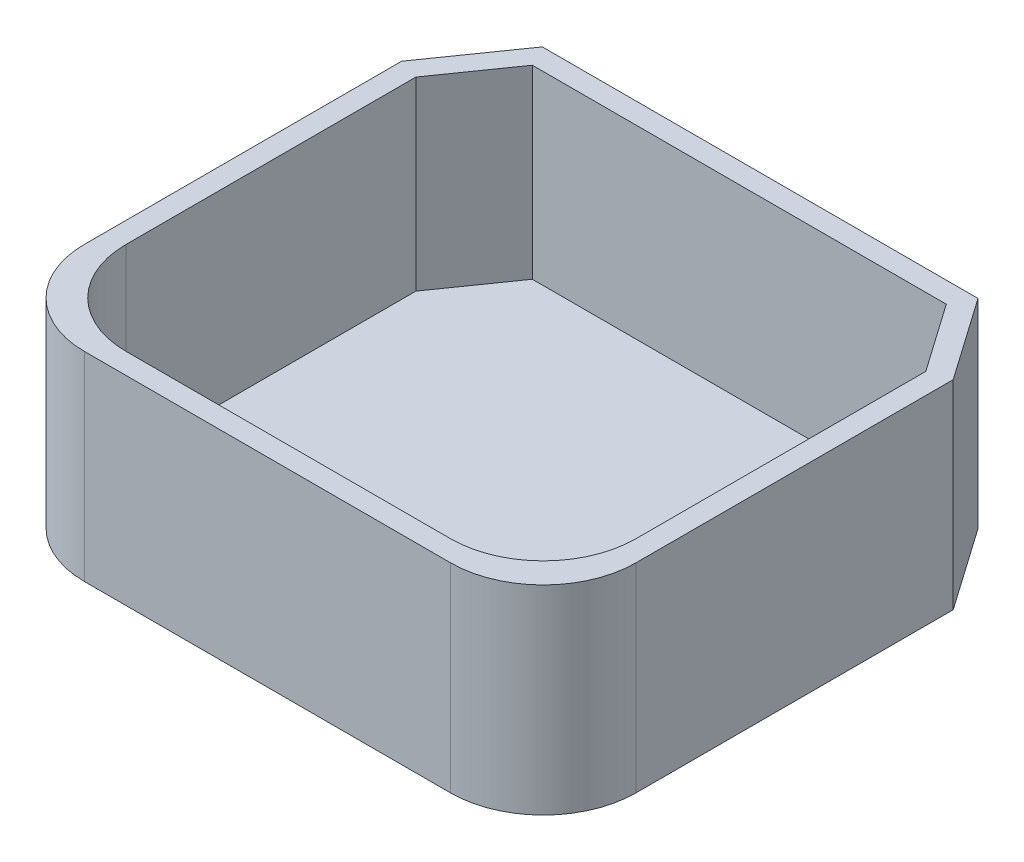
ISO-10303-21;
HEADER;
FILE_DESCRIPTION(('STEP AP214'),'2;1');
FILE_NAME('part.step','',(''),(''),'','','');
FILE_SCHEMA(('AUTOMOTIVE_DESIGN { 1 0 10303 214 1 1 1 1 }'));
ENDSEC;
DATA;
#1=APPLICATION_CONTEXT('core data for automotive mechanical design processes');
#2=APPLICATION_PROTOCOL_DEFINITION('international standard','automotive_design',2000,#1);
#3=PRODUCT_CONTEXT('',#1,'mechanical');
#4=PRODUCT('Part','Part','',(#3));
#5=PRODUCT_RELATED_PRODUCT_CATEGORY('part','',(#4));
#6=PRODUCT_DEFINITION_FORMATION('','',#4);
#7=PRODUCT_DEFINITION_CONTEXT('part definition',#1,'design');
#8=PRODUCT_DEFINITION('design','',#6,#7);
#9=PRODUCT_DEFINITION_SHAPE('','',#8);
#10=(LENGTH_UNIT() NAMED_UNIT(*) SI_UNIT(.MILLI.,.METRE.));
#11=(NAMED_UNIT(*) PLANE_ANGLE_UNIT() SI_UNIT($,.RADIAN.));
#12=(NAMED_UNIT(*) SI_UNIT($,.STERADIAN.) SOLID_ANGLE_UNIT());
#13=UNCERTAINTY_MEASURE_WITH_UNIT(LENGTH_MEASURE(1.E-05),#10,'distance_accuracy_value','');
#14=(GEOMETRIC_REPRESENTATION_CONTEXT(3) GLOBAL_UNCERTAINTY_ASSIGNED_CONTEXT((#13)) GLOBAL_UNIT_ASSIGNED_CONTEXT((#10,
#11,#12)) REPRESENTATION_CONTEXT('',''));
#15=CARTESIAN_POINT('',(0.,0.,0.));
#16=DIRECTION('',(0.,0.,1.));
#17=DIRECTION('',(1.,0.,0.));
#18=AXIS2_PLACEMENT_3D('',#15,#16,#17);
#19=CARTESIAN_POINT('',(0.,0.3,0.));
#20=DIRECTION('',(0.,1.,0.));
#21=DIRECTION('',(0.,0.,1.));
#22=AXIS2_PLACEMENT_3D('',#19,#20,#21);
#23=PLANE('',#22);
#24=CARTESIAN_POINT('',(3.5,0.3,2.865));
#25=DIRECTION('',(0.,1.,0.));
#26=DIRECTION('',(0.,0.,1.));
#27=AXIS2_PLACEMENT_3D('',#24,#25,#26);
#28=CIRCLE('',#27,2.);
#29=CARTESIAN_POINT('',(3.5,0.3,4.865));
#30=VERTEX_POINT('',#29);
#31=CARTESIAN_POINT('',(4.4,0.3,4.65105710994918));
#32=VERTEX_POINT('',#31);
#33=EDGE_CURVE('E349',#30,#32,#28,.T.);
#34=ORIENTED_EDGE('',*,*,#33,.T.);
#35=DIRECTION('',(0.,0.,1.));
#36=VECTOR('',#35,1.);
#37=CARTESIAN_POINT('',(4.4,0.3,3.265));
#38=LINE('',#37,#36);
#39=CARTESIAN_POINT('',(4.4,0.3,3.265));
#40=VERTEX_POINT('',#39);
#41=EDGE_CURVE('E221',#40,#32,#38,.T.);
#42=ORIENTED_EDGE('',*,*,#41,.F.);
#43=DIRECTION('',(-1.,0.,0.));
#44=VECTOR('',#43,1.);
#45=CARTESIAN_POINT('',(4.7,0.3,3.265));
#46=LINE('',#45,#44);
#47=CARTESIAN_POINT('',(4.7,0.3,3.265));
#48=VERTEX_POINT('',#47);
#49=EDGE_CURVE('E224',#48,#40,#46,.T.);
#50=ORIENTED_EDGE('',*,*,#49,.F.);
#51=DIRECTION('',(0.,0.,-1.));
#52=VECTOR('',#51,1.);
#53=CARTESIAN_POINT('',(4.7,0.3,4.865));
#54=LINE('',#53,#52);
#55=CARTESIAN_POINT('',(4.7,0.3,4.465));
#56=VERTEX_POINT('',#55);
#57=EDGE_CURVE('E209',#56,#48,#54,.T.);
#58=ORIENTED_EDGE('',*,*,#57,.F.);
#59=CARTESIAN_POINT('',(5.5,0.3,2.865));
#60=VERTEX_POINT('',#59);
#61=EDGE_CURVE('E348',#56,#60,#28,.T.);
#62=ORIENTED_EDGE('',*,*,#61,.T.);
#63=DIRECTION('',(0.,0.,-1.));
#64=VECTOR('',#63,1.);
#65=CARTESIAN_POINT('',(5.5,0.3,4.865));
#66=LINE('',#65,#64);
#67=CARTESIAN_POINT('',(5.5,0.3,-3.38793053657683));
#68=VERTEX_POINT('',#67);
#69=EDGE_CURVE('E268',#60,#68,#66,.T.);
#70=ORIENTED_EDGE('',*,*,#69,.T.);
#71=DIRECTION('',(-0.57357643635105,0.,-0.819152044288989));
#72=VECTOR('',#71,1.);
#73=CARTESIAN_POINT('',(5.5,0.3,-3.38793053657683));
#74=LINE('',#73,#72);
#75=CARTESIAN_POINT('',(4.46574482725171,0.3,-4.865));
#76=VERTEX_POINT('',#75);
#77=EDGE_CURVE('E246',#68,#76,#74,.T.);
#78=ORIENTED_EDGE('',*,*,#77,.T.);
#79=DIRECTION('',(-1.,0.,0.));
#80=VECTOR('',#79,1.);
#81=CARTESIAN_POINT('',(4.46574482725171,0.3,-4.865));
#82=LINE('',#81,#80);
#83=CARTESIAN_POINT('',(-4.46574482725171,0.3,-4.865));
#84=VERTEX_POINT('',#83);
#85=EDGE_CURVE('E242',#76,#84,#82,.T.);
#86=ORIENTED_EDGE('',*,*,#85,.T.);
#87=DIRECTION('',(-0.573576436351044,0.,0.819152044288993));
#88=VECTOR('',#87,1.);
#89=CARTESIAN_POINT('',(-4.46574482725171,0.3,-4.865));
#90=LINE('',#89,#88);
#91=CARTESIAN_POINT('',(-5.5,0.3,-3.3879305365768));
#92=VERTEX_POINT('',#91);
#93=EDGE_CURVE('E260',#84,#92,#90,.T.);
#94=ORIENTED_EDGE('',*,*,#93,.T.);
#95=DIRECTION('',(0.,0.,1.));
#96=VECTOR('',#95,1.);
#97=CARTESIAN_POINT('',(-5.5,0.3,-3.3879305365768));
#98=LINE('',#97,#96);
#99=CARTESIAN_POINT('',(-5.5,0.3,2.865));
#100=VERTEX_POINT('',#99);
#101=EDGE_CURVE('E262',#92,#100,#98,.T.);
#102=ORIENTED_EDGE('',*,*,#101,.T.);
#103=CARTESIAN_POINT('',(-3.5,0.3,2.865));
#104=DIRECTION('',(0.,1.,0.));
#105=DIRECTION('',(0.,0.,1.));
#106=AXIS2_PLACEMENT_3D('',#103,#104,#105);
#107=CIRCLE('',#106,2.);
#108=CARTESIAN_POINT('',(-4.7,0.3,4.465));
#109=VERTEX_POINT('',#108);
#110=EDGE_CURVE('E345',#100,#109,#107,.T.);
#111=ORIENTED_EDGE('',*,*,#110,.T.);
#112=DIRECTION('',(0.,0.,1.));
#113=VECTOR('',#112,1.);
#114=CARTESIAN_POINT('',(-4.7,0.3,3.265));
#115=LINE('',#114,#113);
#116=CARTESIAN_POINT('',(-4.7,0.3,3.265));
#117=VERTEX_POINT('',#116);
#118=EDGE_CURVE('E212',#117,#109,#115,.T.);
#119=ORIENTED_EDGE('',*,*,#118,.F.);
#120=DIRECTION('',(-1.,0.,0.));
#121=VECTOR('',#120,1.);
#122=CARTESIAN_POINT('',(-4.4,0.3,3.265));
#123=LINE('',#122,#121);
#124=CARTESIAN_POINT('',(-4.4,0.3,3.265));
#125=VERTEX_POINT('',#124);
#126=EDGE_CURVE('E228',#125,#117,#123,.T.);
#127=ORIENTED_EDGE('',*,*,#126,.F.);
#128=DIRECTION('',(0.,0.,-1.));
#129=VECTOR('',#128,1.);
#130=CARTESIAN_POINT('',(-4.4,0.3,4.865));
#131=LINE('',#130,#129);
#132=CARTESIAN_POINT('',(-4.4,0.3,4.65105710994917));
#133=VERTEX_POINT('',#132);
#134=EDGE_CURVE('E234',#133,#125,#131,.T.);
#135=ORIENTED_EDGE('',*,*,#134,.F.);
#136=CARTESIAN_POINT('',(-3.5,0.3,4.865));
#137=VERTEX_POINT('',#136);
#138=EDGE_CURVE('E344',#133,#137,#107,.T.);
#139=ORIENTED_EDGE('',*,*,#138,.T.);
#140=DIRECTION('',(1.,0.,0.));
#141=VECTOR('',#140,1.);
#142=CARTESIAN_POINT('',(-5.5,0.3,4.865));
#143=LINE('',#142,#141);
#144=EDGE_CURVE('E265',#137,#30,#143,.T.);
#145=ORIENTED_EDGE('',*,*,#144,.T.);
#146=EDGE_LOOP('',(#34,#42,#50,#58,#62,#70,#78,#86,#94,#102,#111,#119,#127,#135,#139,#145));
#147=FACE_BOUND('',#146,.T.);
#148=ADVANCED_FACE('F36',(#147),#23,.T.);
#149=CARTESIAN_POINT('',(3.5,4.3,2.865));
#150=DIRECTION('',(0.,1.,0.));
#151=DIRECTION('',(0.,0.,1.));
#152=AXIS2_PLACEMENT_3D('',#149,#150,#151);
#153=CYLINDRICAL_SURFACE('',#152,2.);
#154=DIRECTION('',(0.,1.,0.));
#155=VECTOR('',#154,1.);
#156=CARTESIAN_POINT('',(4.4,4.3,4.65105710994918));
#157=LINE('',#156,#155);
#158=CARTESIAN_POINT('',(4.4,2.3,4.65105710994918));
#159=VERTEX_POINT('',#158);
#160=EDGE_CURVE('E11',#32,#159,#157,.T.);
#161=ORIENTED_EDGE('',*,*,#160,.F.);
#162=ORIENTED_EDGE('',*,*,#33,.F.);
#163=DIRECTION('',(0.,-1.,0.));
#164=VECTOR('',#163,1.);
#165=CARTESIAN_POINT('',(3.5,0.3,4.865));
#166=LINE('',#165,#164);
#167=CARTESIAN_POINT('',(3.5,4.3,4.865));
#168=VERTEX_POINT('',#167);
#169=EDGE_CURVE('E341',#168,#30,#166,.T.);
#170=ORIENTED_EDGE('',*,*,#169,.F.);
#171=CARTESIAN_POINT('',(3.5,4.3,2.865));
#172=DIRECTION('',(0.,1.,0.));
#173=DIRECTION('',(0.,0.,1.));
#174=AXIS2_PLACEMENT_3D('',#171,#172,#173);
#175=CIRCLE('',#174,2.);
#176=CARTESIAN_POINT('',(5.5,4.3,2.865));
#177=VERTEX_POINT('',#176);
#178=EDGE_CURVE('E357',#177,#168,#175,.F.);
#179=ORIENTED_EDGE('',*,*,#178,.F.);
#180=DIRECTION('',(0.,-1.,0.));
#181=VECTOR('',#180,1.);
#182=CARTESIAN_POINT('',(5.5,4.3,2.865));
#183=LINE('',#182,#181);
#184=EDGE_CURVE('E352',#60,#177,#183,.F.);
#185=ORIENTED_EDGE('',*,*,#184,.F.);
#186=ORIENTED_EDGE('',*,*,#61,.F.);
#187=DIRECTION('',(0.,1.,0.));
#188=VECTOR('',#187,1.);
#189=CARTESIAN_POINT('',(4.7,4.3,4.465));
#190=LINE('',#189,#188);
#191=CARTESIAN_POINT('',(4.7,2.3,4.465));
#192=VERTEX_POINT('',#191);
#193=EDGE_CURVE('E44',#192,#56,#190,.F.);
#194=ORIENTED_EDGE('',*,*,#193,.F.);
#195=CARTESIAN_POINT('',(3.5,2.3,2.865));
#196=DIRECTION('',(0.,1.,0.));
#197=DIRECTION('',(0.,0.,1.));
#198=AXIS2_PLACEMENT_3D('',#195,#196,#197);
#199=CIRCLE('',#198,2.);
#200=EDGE_CURVE('E201',#192,#159,#199,.F.);
#201=ORIENTED_EDGE('',*,*,#200,.T.);
#202=EDGE_LOOP('',(#161,#162,#170,#179,#185,#186,#194,#201));
#203=FACE_BOUND('',#202,.T.);
#204=ADVANCED_FACE('F379',(#203),#153,.F.);
#205=CARTESIAN_POINT('',(-3.5,4.3,2.865));
#206=DIRECTION('',(0.,1.,0.));
#207=DIRECTION('',(0.,0.,1.));
#208=AXIS2_PLACEMENT_3D('',#205,#206,#207);
#209=CYLINDRICAL_SURFACE('',#208,2.);
#210=DIRECTION('',(0.,1.,0.));
#211=VECTOR('',#210,1.);
#212=CARTESIAN_POINT('',(-4.7,4.3,4.465));
#213=LINE('',#212,#211);
#214=CARTESIAN_POINT('',(-4.7,2.3,4.465));
#215=VERTEX_POINT('',#214);
#216=EDGE_CURVE('E370',#109,#215,#213,.T.);
#217=ORIENTED_EDGE('',*,*,#216,.F.);
#218=ORIENTED_EDGE('',*,*,#110,.F.);
#219=DIRECTION('',(0.,-1.,0.));
#220=VECTOR('',#219,1.);
#221=CARTESIAN_POINT('',(-5.5,0.3,2.865));
#222=LINE('',#221,#220);
#223=CARTESIAN_POINT('',(-5.5,4.3,2.865));
#224=VERTEX_POINT('',#223);
#225=EDGE_CURVE('E354',#224,#100,#222,.T.);
#226=ORIENTED_EDGE('',*,*,#225,.F.);
#227=CARTESIAN_POINT('',(-3.5,4.3,2.865));
#228=DIRECTION('',(0.,1.,0.));
#229=DIRECTION('',(0.,0.,1.));
#230=AXIS2_PLACEMENT_3D('',#227,#228,#229);
#231=CIRCLE('',#230,2.);
#232=CARTESIAN_POINT('',(-3.5,4.3,4.865));
#233=VERTEX_POINT('',#232);
#234=EDGE_CURVE('E359',#233,#224,#231,.F.);
#235=ORIENTED_EDGE('',*,*,#234,.F.);
#236=DIRECTION('',(0.,-1.,0.));
#237=VECTOR('',#236,1.);
#238=CARTESIAN_POINT('',(-3.5,4.3,4.865));
#239=LINE('',#238,#237);
#240=EDGE_CURVE('E339',#137,#233,#239,.F.);
#241=ORIENTED_EDGE('',*,*,#240,.F.);
#242=ORIENTED_EDGE('',*,*,#138,.F.);
#243=DIRECTION('',(0.,1.,0.));
#244=VECTOR('',#243,1.);
#245=CARTESIAN_POINT('',(-4.4,4.3,4.65105710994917));
#246=LINE('',#245,#244);
#247=CARTESIAN_POINT('',(-4.4,2.3,4.65105710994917));
#248=VERTEX_POINT('',#247);
#249=EDGE_CURVE('E368',#248,#133,#246,.F.);
#250=ORIENTED_EDGE('',*,*,#249,.F.);
#251=CARTESIAN_POINT('',(-3.5,2.3,2.865));
#252=DIRECTION('',(0.,1.,0.));
#253=DIRECTION('',(0.,0.,1.));
#254=AXIS2_PLACEMENT_3D('',#251,#252,#253);
#255=CIRCLE('',#254,2.);
#256=EDGE_CURVE('E365',#248,#215,#255,.F.);
#257=ORIENTED_EDGE('',*,*,#256,.T.);
#258=EDGE_LOOP('',(#217,#218,#226,#235,#241,#242,#250,#257));
#259=FACE_BOUND('',#258,.T.);
#260=ADVANCED_FACE('F38',(#259),#209,.F.);
#261=CARTESIAN_POINT('',(-5.95,0.3,-3.52981499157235));
#262=DIRECTION('',(1.,0.,0.));
#263=DIRECTION('',(0.,0.,-1.));
#264=AXIS2_PLACEMENT_3D('',#261,#262,#263);
#265=PLANE('',#264);
#266=DIRECTION('',(0.,0.,1.));
#267=VECTOR('',#266,1.);
#268=CARTESIAN_POINT('',(-5.95,0.,-3.52981499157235));
#269=LINE('',#268,#267);
#270=CARTESIAN_POINT('',(-5.95,0.,-3.52981499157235));
#271=VERTEX_POINT('',#270);
#272=CARTESIAN_POINT('',(-5.95,0.,3.315));
#273=VERTEX_POINT('',#272);
#274=EDGE_CURVE('E299',#271,#273,#269,.T.);
#275=ORIENTED_EDGE('',*,*,#274,.T.);
#276=DIRECTION('',(0.,-1.,0.));
#277=VECTOR('',#276,1.);
#278=CARTESIAN_POINT('',(-5.95,0.3,3.315));
#279=LINE('',#278,#277);
#280=CARTESIAN_POINT('',(-5.95,4.3,3.315));
#281=VERTEX_POINT('',#280);
#282=EDGE_CURVE('E334',#273,#281,#279,.F.);
#283=ORIENTED_EDGE('',*,*,#282,.T.);
#284=DIRECTION('',(0.,0.,1.));
#285=VECTOR('',#284,1.);
#286=CARTESIAN_POINT('',(-5.95,4.3,-3.52981499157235));
#287=LINE('',#286,#285);
#288=CARTESIAN_POINT('',(-5.95,4.3,-3.52981499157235));
#289=VERTEX_POINT('',#288);
#290=EDGE_CURVE('E288',#289,#281,#287,.T.);
#291=ORIENTED_EDGE('',*,*,#290,.F.);
#292=DIRECTION('',(0.,-1.,0.));
#293=VECTOR('',#292,1.);
#294=CARTESIAN_POINT('',(-5.95,0.3,-3.52981499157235));
#295=LINE('',#294,#293);
#296=EDGE_CURVE('E313',#289,#271,#295,.T.);
#297=ORIENTED_EDGE('',*,*,#296,.T.);
#298=EDGE_LOOP('',(#275,#283,#291,#297));
#299=FACE_BOUND('',#298,.T.);
#300=ADVANCED_FACE('F472',(#299),#265,.F.);
#301=CARTESIAN_POINT('',(-5.95,0.3,5.315));
#302=DIRECTION('',(0.,0.,-1.));
#303=DIRECTION('',(-1.,0.,0.));
#304=AXIS2_PLACEMENT_3D('',#301,#302,#303);
#305=PLANE('',#304);
#306=DIRECTION('',(1.,0.,0.));
#307=VECTOR('',#306,1.);
#308=CARTESIAN_POINT('',(-5.95,4.3,5.315));
#309=LINE('',#308,#307);
#310=CARTESIAN_POINT('',(-3.95,4.3,5.315));
#311=VERTEX_POINT('',#310);
#312=CARTESIAN_POINT('',(3.95,4.3,5.315));
#313=VERTEX_POINT('',#312);
#314=EDGE_CURVE('E291',#311,#313,#309,.T.);
#315=ORIENTED_EDGE('',*,*,#314,.F.);
#316=DIRECTION('',(0.,-1.,0.));
#317=VECTOR('',#316,1.);
#318=CARTESIAN_POINT('',(-3.95,0.3,5.315));
#319=LINE('',#318,#317);
#320=CARTESIAN_POINT('',(-3.95,0.,5.315));
#321=VERTEX_POINT('',#320);
#322=EDGE_CURVE('E327',#311,#321,#319,.T.);
#323=ORIENTED_EDGE('',*,*,#322,.T.);
#324=DIRECTION('',(1.,0.,0.));
#325=VECTOR('',#324,1.);
#326=CARTESIAN_POINT('',(-5.95,0.,5.315));
#327=LINE('',#326,#325);
#328=CARTESIAN_POINT('',(3.95,0.,5.315));
#329=VERTEX_POINT('',#328);
#330=EDGE_CURVE('E302',#321,#329,#327,.T.);
#331=ORIENTED_EDGE('',*,*,#330,.T.);
#332=DIRECTION('',(0.,-1.,0.));
#333=VECTOR('',#332,1.);
#334=CARTESIAN_POINT('',(3.95,0.3,5.315));
#335=LINE('',#334,#333);
#336=EDGE_CURVE('E325',#329,#313,#335,.F.);
#337=ORIENTED_EDGE('',*,*,#336,.T.);
#338=EDGE_LOOP('',(#315,#323,#331,#337));
#339=FACE_BOUND('',#338,.T.);
#340=ADVANCED_FACE('F468',(#339),#305,.F.);
#341=CARTESIAN_POINT('',(5.95,0.3,-3.52981499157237));
#342=DIRECTION('',(-1.,0.,0.));
#343=DIRECTION('',(0.,0.,1.));
#344=AXIS2_PLACEMENT_3D('',#341,#342,#343);
#345=PLANE('',#344);
#346=DIRECTION('',(0.,0.,-1.));
#347=VECTOR('',#346,1.);
#348=CARTESIAN_POINT('',(5.95,4.3,5.315));
#349=LINE('',#348,#347);
#350=CARTESIAN_POINT('',(5.95,4.3,3.315));
#351=VERTEX_POINT('',#350);
#352=CARTESIAN_POINT('',(5.95,4.3,-3.52981499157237));
#353=VERTEX_POINT('',#352);
#354=EDGE_CURVE('E294',#351,#353,#349,.T.);
#355=ORIENTED_EDGE('',*,*,#354,.F.);
#356=DIRECTION('',(0.,-1.,0.));
#357=VECTOR('',#356,1.);
#358=CARTESIAN_POINT('',(5.95,0.3,3.315));
#359=LINE('',#358,#357);
#360=CARTESIAN_POINT('',(5.95,0.,3.315));
#361=VERTEX_POINT('',#360);
#362=EDGE_CURVE('E336',#351,#361,#359,.T.);
#363=ORIENTED_EDGE('',*,*,#362,.T.);
#364=DIRECTION('',(0.,0.,-1.));
#365=VECTOR('',#364,1.);
#366=CARTESIAN_POINT('',(5.95,0.,-3.52981499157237));
#367=LINE('',#366,#365);
#368=CARTESIAN_POINT('',(5.95,0.,-3.52981499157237));
#369=VERTEX_POINT('',#368);
#370=EDGE_CURVE('E305',#361,#369,#367,.T.);
#371=ORIENTED_EDGE('',*,*,#370,.T.);
#372=DIRECTION('',(0.,-1.,0.));
#373=VECTOR('',#372,1.);
#374=CARTESIAN_POINT('',(5.95,0.3,-3.52981499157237));
#375=LINE('',#374,#373);
#376=EDGE_CURVE('E322',#353,#369,#375,.T.);
#377=ORIENTED_EDGE('',*,*,#376,.F.);
#378=EDGE_LOOP('',(#355,#363,#371,#377));
#379=FACE_BOUND('',#378,.T.);
#380=ADVANCED_FACE('F464',(#379),#345,.F.);
#381=CARTESIAN_POINT('',(4.7,0.3,-5.315));
#382=DIRECTION('',(-0.819152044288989,0.,0.57357643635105));
#383=DIRECTION('',(0.57357643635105,0.,0.819152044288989));
#384=AXIS2_PLACEMENT_3D('',#381,#382,#383);
#385=PLANE('',#384);
#386=DIRECTION('',(-0.57357643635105,0.,-0.819152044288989));
#387=VECTOR('',#386,1.);
#388=CARTESIAN_POINT('',(4.7,0.,-5.315));
#389=LINE('',#388,#387);
#390=CARTESIAN_POINT('',(4.7,0.,-5.315));
#391=VERTEX_POINT('',#390);
#392=EDGE_CURVE('E307',#369,#391,#389,.T.);
#393=ORIENTED_EDGE('',*,*,#392,.T.);
#394=DIRECTION('',(0.,-1.,0.));
#395=VECTOR('',#394,1.);
#396=CARTESIAN_POINT('',(4.7,0.3,-5.315));
#397=LINE('',#396,#395);
#398=CARTESIAN_POINT('',(4.7,4.3,-5.315));
#399=VERTEX_POINT('',#398);
#400=EDGE_CURVE('E319',#399,#391,#397,.T.);
#401=ORIENTED_EDGE('',*,*,#400,.F.);
#402=DIRECTION('',(-0.57357643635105,0.,-0.819152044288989));
#403=VECTOR('',#402,1.);
#404=CARTESIAN_POINT('',(5.95,4.3,-3.52981499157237));
#405=LINE('',#404,#403);
#406=EDGE_CURVE('E296',#353,#399,#405,.T.);
#407=ORIENTED_EDGE('',*,*,#406,.F.);
#408=ORIENTED_EDGE('',*,*,#376,.T.);
#409=EDGE_LOOP('',(#393,#401,#407,#408));
#410=FACE_BOUND('',#409,.T.);
#411=ADVANCED_FACE('F460',(#410),#385,.F.);
#412=CARTESIAN_POINT('',(4.7,0.3,-5.315));
#413=DIRECTION('',(0.,0.,1.));
#414=DIRECTION('',(1.,0.,0.));
#415=AXIS2_PLACEMENT_3D('',#412,#413,#414);
#416=PLANE('',#415);
#417=DIRECTION('',(-1.,0.,0.));
#418=VECTOR('',#417,1.);
#419=CARTESIAN_POINT('',(4.7,0.,-5.315));
#420=LINE('',#419,#418);
#421=CARTESIAN_POINT('',(-4.7,0.,-5.315));
#422=VERTEX_POINT('',#421);
#423=EDGE_CURVE('E309',#391,#422,#420,.T.);
#424=ORIENTED_EDGE('',*,*,#423,.T.);
#425=DIRECTION('',(0.,-1.,0.));
#426=VECTOR('',#425,1.);
#427=CARTESIAN_POINT('',(-4.7,0.3,-5.315));
#428=LINE('',#427,#426);
#429=CARTESIAN_POINT('',(-4.7,4.3,-5.315));
#430=VERTEX_POINT('',#429);
#431=EDGE_CURVE('E316',#430,#422,#428,.T.);
#432=ORIENTED_EDGE('',*,*,#431,.F.);
#433=DIRECTION('',(-1.,0.,0.));
#434=VECTOR('',#433,1.);
#435=CARTESIAN_POINT('',(4.7,4.3,-5.315));
#436=LINE('',#435,#434);
#437=EDGE_CURVE('E282',#399,#430,#436,.T.);
#438=ORIENTED_EDGE('',*,*,#437,.F.);
#439=ORIENTED_EDGE('',*,*,#400,.T.);
#440=EDGE_LOOP('',(#424,#432,#438,#439));
#441=FACE_BOUND('',#440,.T.);
#442=ADVANCED_FACE('F456',(#441),#416,.F.);
#443=CARTESIAN_POINT('',(-4.7,0.3,-5.315));
#444=DIRECTION('',(0.819152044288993,0.,0.573576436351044));
#445=DIRECTION('',(0.573576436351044,0.,-0.819152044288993));
#446=AXIS2_PLACEMENT_3D('',#443,#444,#445);
#447=PLANE('',#446);
#448=DIRECTION('',(-0.573576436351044,0.,0.819152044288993));
#449=VECTOR('',#448,1.);
#450=CARTESIAN_POINT('',(-4.7,0.,-5.315));
#451=LINE('',#450,#449);
#452=EDGE_CURVE('E311',#422,#271,#451,.T.);
#453=ORIENTED_EDGE('',*,*,#452,.T.);
#454=ORIENTED_EDGE('',*,*,#296,.F.);
#455=DIRECTION('',(-0.573576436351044,0.,0.819152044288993));
#456=VECTOR('',#455,1.);
#457=CARTESIAN_POINT('',(-4.7,4.3,-5.315));
#458=LINE('',#457,#456);
#459=EDGE_CURVE('E285',#430,#289,#458,.T.);
#460=ORIENTED_EDGE('',*,*,#459,.F.);
#461=ORIENTED_EDGE('',*,*,#431,.T.);
#462=EDGE_LOOP('',(#453,#454,#460,#461));
#463=FACE_BOUND('',#462,.T.);
#464=ADVANCED_FACE('F452',(#463),#447,.F.);
#465=CARTESIAN_POINT('',(0.,0.,0.));
#466=DIRECTION('',(0.,1.,0.));
#467=DIRECTION('',(0.,0.,1.));
#468=AXIS2_PLACEMENT_3D('',#465,#466,#467);
#469=PLANE('',#468);
#470=ORIENTED_EDGE('',*,*,#330,.F.);
#471=CARTESIAN_POINT('',(-3.95,0.,3.315));
#472=DIRECTION('',(0.,1.,0.));
#473=DIRECTION('',(0.,0.,1.));
#474=AXIS2_PLACEMENT_3D('',#471,#472,#473);
#475=CIRCLE('',#474,2.);
#476=EDGE_CURVE('E332',#321,#273,#475,.F.);
#477=ORIENTED_EDGE('',*,*,#476,.T.);
#478=ORIENTED_EDGE('',*,*,#274,.F.);
#479=ORIENTED_EDGE('',*,*,#452,.F.);
#480=ORIENTED_EDGE('',*,*,#423,.F.);
#481=ORIENTED_EDGE('',*,*,#392,.F.);
#482=ORIENTED_EDGE('',*,*,#370,.F.);
#483=CARTESIAN_POINT('',(3.95,0.,3.315));
#484=DIRECTION('',(0.,1.,0.));
#485=DIRECTION('',(0.,0.,1.));
#486=AXIS2_PLACEMENT_3D('',#483,#484,#485);
#487=CIRCLE('',#486,2.);
#488=EDGE_CURVE('E330',#361,#329,#487,.F.);
#489=ORIENTED_EDGE('',*,*,#488,.T.);
#490=EDGE_LOOP('',(#470,#477,#478,#479,#480,#481,#482,#489));
#491=FACE_BOUND('',#490,.T.);
#492=ADVANCED_FACE('F449',(#491),#469,.F.);
#493=CARTESIAN_POINT('',(0.,4.3,0.));
#494=DIRECTION('',(0.,1.,0.));
#495=DIRECTION('',(0.,0.,1.));
#496=AXIS2_PLACEMENT_3D('',#493,#494,#495);
#497=PLANE('',#496);
#498=ORIENTED_EDGE('',*,*,#290,.T.);
#499=CARTESIAN_POINT('',(-3.95,4.3,3.315));
#500=DIRECTION('',(0.,1.,0.));
#501=DIRECTION('',(0.,0.,1.));
#502=AXIS2_PLACEMENT_3D('',#499,#500,#501);
#503=CIRCLE('',#502,2.);
#504=EDGE_CURVE('E363',#281,#311,#503,.T.);
#505=ORIENTED_EDGE('',*,*,#504,.T.);
#506=ORIENTED_EDGE('',*,*,#314,.T.);
#507=CARTESIAN_POINT('',(3.95,4.3,3.315));
#508=DIRECTION('',(0.,1.,0.));
#509=DIRECTION('',(0.,0.,1.));
#510=AXIS2_PLACEMENT_3D('',#507,#508,#509);
#511=CIRCLE('',#510,2.);
#512=EDGE_CURVE('E361',#313,#351,#511,.T.);
#513=ORIENTED_EDGE('',*,*,#512,.T.);
#514=ORIENTED_EDGE('',*,*,#354,.T.);
#515=ORIENTED_EDGE('',*,*,#406,.T.);
#516=ORIENTED_EDGE('',*,*,#437,.T.);
#517=ORIENTED_EDGE('',*,*,#459,.T.);
#518=EDGE_LOOP('',(#498,#505,#506,#513,#514,#515,#516,#517));
#519=FACE_BOUND('',#518,.T.);
#520=DIRECTION('',(-0.573576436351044,0.,0.819152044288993));
#521=VECTOR('',#520,1.);
#522=CARTESIAN_POINT('',(-4.46574482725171,4.3,-4.865));
#523=LINE('',#522,#521);
#524=CARTESIAN_POINT('',(-4.46574482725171,4.3,-4.865));
#525=VERTEX_POINT('',#524);
#526=CARTESIAN_POINT('',(-5.5,4.3,-3.3879305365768));
#527=VERTEX_POINT('',#526);
#528=EDGE_CURVE('E245',#525,#527,#523,.T.);
#529=ORIENTED_EDGE('',*,*,#528,.F.);
#530=DIRECTION('',(-1.,0.,0.));
#531=VECTOR('',#530,1.);
#532=CARTESIAN_POINT('',(4.46574482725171,4.3,-4.865));
#533=LINE('',#532,#531);
#534=CARTESIAN_POINT('',(4.46574482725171,4.3,-4.865));
#535=VERTEX_POINT('',#534);
#536=EDGE_CURVE('E243',#535,#525,#533,.T.);
#537=ORIENTED_EDGE('',*,*,#536,.F.);
#538=DIRECTION('',(-0.57357643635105,0.,-0.819152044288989));
#539=VECTOR('',#538,1.);
#540=CARTESIAN_POINT('',(5.5,4.3,-3.38793053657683));
#541=LINE('',#540,#539);
#542=CARTESIAN_POINT('',(5.5,4.3,-3.38793053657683));
#543=VERTEX_POINT('',#542);
#544=EDGE_CURVE('E256',#543,#535,#541,.T.);
#545=ORIENTED_EDGE('',*,*,#544,.F.);
#546=DIRECTION('',(0.,0.,-1.));
#547=VECTOR('',#546,1.);
#548=CARTESIAN_POINT('',(5.5,4.3,4.865));
#549=LINE('',#548,#547);
#550=EDGE_CURVE('E254',#177,#543,#549,.T.);
#551=ORIENTED_EDGE('',*,*,#550,.F.);
#552=ORIENTED_EDGE('',*,*,#178,.T.);
#553=DIRECTION('',(1.,0.,0.));
#554=VECTOR('',#553,1.);
#555=CARTESIAN_POINT('',(-5.5,4.3,4.865));
#556=LINE('',#555,#554);
#557=EDGE_CURVE('E251',#233,#168,#556,.T.);
#558=ORIENTED_EDGE('',*,*,#557,.F.);
#559=ORIENTED_EDGE('',*,*,#234,.T.);
#560=DIRECTION('',(0.,0.,1.));
#561=VECTOR('',#560,1.);
#562=CARTESIAN_POINT('',(-5.5,4.3,-3.3879305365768));
#563=LINE('',#562,#561);
#564=EDGE_CURVE('E248',#527,#224,#563,.T.);
#565=ORIENTED_EDGE('',*,*,#564,.F.);
#566=EDGE_LOOP('',(#529,#537,#545,#551,#552,#558,#559,#565));
#567=FACE_BOUND('',#566,.T.);
#568=ADVANCED_FACE('F389',(#519,#567),#497,.T.);
#569=CARTESIAN_POINT('',(4.46574482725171,4.3,-4.865));
#570=DIRECTION('',(0.,0.,1.));
#571=DIRECTION('',(1.,0.,0.));
#572=AXIS2_PLACEMENT_3D('',#569,#570,#571);
#573=PLANE('',#572);
#574=ORIENTED_EDGE('',*,*,#85,.F.);
#575=DIRECTION('',(0.,-1.,0.));
#576=VECTOR('',#575,1.);
#577=CARTESIAN_POINT('',(4.46574482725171,4.3,-4.865));
#578=LINE('',#577,#576);
#579=EDGE_CURVE('E258',#535,#76,#578,.T.);
#580=ORIENTED_EDGE('',*,*,#579,.F.);
#581=ORIENTED_EDGE('',*,*,#536,.T.);
#582=DIRECTION('',(0.,-1.,0.));
#583=VECTOR('',#582,1.);
#584=CARTESIAN_POINT('',(-4.46574482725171,4.3,-4.865));
#585=LINE('',#584,#583);
#586=EDGE_CURVE('E279',#525,#84,#585,.T.);
#587=ORIENTED_EDGE('',*,*,#586,.T.);
#588=EDGE_LOOP('',(#574,#580,#581,#587));
#589=FACE_BOUND('',#588,.T.);
#590=ADVANCED_FACE('F398',(#589),#573,.T.);
#591=CARTESIAN_POINT('',(-4.46574482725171,4.3,-4.865));
#592=DIRECTION('',(0.819152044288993,0.,0.573576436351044));
#593=DIRECTION('',(0.573576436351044,0.,-0.819152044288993));
#594=AXIS2_PLACEMENT_3D('',#591,#592,#593);
#595=PLANE('',#594);
#596=ORIENTED_EDGE('',*,*,#93,.F.);
#597=ORIENTED_EDGE('',*,*,#586,.F.);
#598=ORIENTED_EDGE('',*,*,#528,.T.);
#599=DIRECTION('',(0.,-1.,0.));
#600=VECTOR('',#599,1.);
#601=CARTESIAN_POINT('',(-5.5,4.3,-3.3879305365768));
#602=LINE('',#601,#600);
#603=EDGE_CURVE('E276',#527,#92,#602,.T.);
#604=ORIENTED_EDGE('',*,*,#603,.T.);
#605=EDGE_LOOP('',(#596,#597,#598,#604));
#606=FACE_BOUND('',#605,.T.);
#607=ADVANCED_FACE('F402',(#606),#595,.T.);
#608=CARTESIAN_POINT('',(-5.5,4.3,-3.3879305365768));
#609=DIRECTION('',(1.,0.,0.));
#610=DIRECTION('',(0.,0.,-1.));
#611=AXIS2_PLACEMENT_3D('',#608,#609,#610);
#612=PLANE('',#611);
#613=ORIENTED_EDGE('',*,*,#564,.T.);
#614=ORIENTED_EDGE('',*,*,#225,.T.);
#615=ORIENTED_EDGE('',*,*,#101,.F.);
#616=ORIENTED_EDGE('',*,*,#603,.F.);
#617=EDGE_LOOP('',(#613,#614,#615,#616));
#618=FACE_BOUND('',#617,.T.);
#619=ADVANCED_FACE('F407',(#618),#612,.T.);
#620=CARTESIAN_POINT('',(-5.5,4.3,4.865));
#621=DIRECTION('',(0.,0.,-1.));
#622=DIRECTION('',(-1.,0.,0.));
#623=AXIS2_PLACEMENT_3D('',#620,#621,#622);
#624=PLANE('',#623);
#625=ORIENTED_EDGE('',*,*,#557,.T.);
#626=ORIENTED_EDGE('',*,*,#169,.T.);
#627=ORIENTED_EDGE('',*,*,#144,.F.);
#628=ORIENTED_EDGE('',*,*,#240,.T.);
#629=EDGE_LOOP('',(#625,#626,#627,#628));
#630=FACE_BOUND('',#629,.T.);
#631=ADVANCED_FACE('F428',(#630),#624,.T.);
#632=CARTESIAN_POINT('',(5.5,4.3,4.865));
#633=DIRECTION('',(-1.,0.,0.));
#634=DIRECTION('',(0.,0.,1.));
#635=AXIS2_PLACEMENT_3D('',#632,#633,#634);
#636=PLANE('',#635);
#637=ORIENTED_EDGE('',*,*,#69,.F.);
#638=ORIENTED_EDGE('',*,*,#184,.T.);
#639=ORIENTED_EDGE('',*,*,#550,.T.);
#640=DIRECTION('',(0.,-1.,0.));
#641=VECTOR('',#640,1.);
#642=CARTESIAN_POINT('',(5.5,4.3,-3.38793053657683));
#643=LINE('',#642,#641);
#644=EDGE_CURVE('E273',#543,#68,#643,.T.);
#645=ORIENTED_EDGE('',*,*,#644,.T.);
#646=EDGE_LOOP('',(#637,#638,#639,#645));
#647=FACE_BOUND('',#646,.T.);
#648=ADVANCED_FACE('F384',(#647),#636,.T.);
#649=CARTESIAN_POINT('',(5.5,4.3,-3.38793053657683));
#650=DIRECTION('',(-0.819152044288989,0.,0.57357643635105));
#651=DIRECTION('',(0.57357643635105,0.,0.819152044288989));
#652=AXIS2_PLACEMENT_3D('',#649,#650,#651);
#653=PLANE('',#652);
#654=ORIENTED_EDGE('',*,*,#77,.F.);
#655=ORIENTED_EDGE('',*,*,#644,.F.);
#656=ORIENTED_EDGE('',*,*,#544,.T.);
#657=ORIENTED_EDGE('',*,*,#579,.T.);
#658=EDGE_LOOP('',(#654,#655,#656,#657));
#659=FACE_BOUND('',#658,.T.);
#660=ADVANCED_FACE('F395',(#659),#653,.T.);
#661=CARTESIAN_POINT('',(-3.95,0.3,3.315));
#662=DIRECTION('',(0.,-1.,0.));
#663=DIRECTION('',(0.,0.,-1.));
#664=AXIS2_PLACEMENT_3D('',#661,#662,#663);
#665=CYLINDRICAL_SURFACE('',#664,2.);
#666=ORIENTED_EDGE('',*,*,#504,.F.);
#667=ORIENTED_EDGE('',*,*,#282,.F.);
#668=ORIENTED_EDGE('',*,*,#476,.F.);
#669=ORIENTED_EDGE('',*,*,#322,.F.);
#670=EDGE_LOOP('',(#666,#667,#668,#669));
#671=FACE_BOUND('',#670,.T.);
#672=ADVANCED_FACE('F477',(#671),#665,.T.);
#673=CARTESIAN_POINT('',(3.95,0.3,3.315));
#674=DIRECTION('',(0.,-1.,0.));
#675=DIRECTION('',(0.,0.,-1.));
#676=AXIS2_PLACEMENT_3D('',#673,#674,#675);
#677=CYLINDRICAL_SURFACE('',#676,2.);
#678=ORIENTED_EDGE('',*,*,#512,.F.);
#679=ORIENTED_EDGE('',*,*,#336,.F.);
#680=ORIENTED_EDGE('',*,*,#488,.F.);
#681=ORIENTED_EDGE('',*,*,#362,.F.);
#682=EDGE_LOOP('',(#678,#679,#680,#681));
#683=FACE_BOUND('',#682,.T.);
#684=ADVANCED_FACE('F480',(#683),#677,.T.);
#685=CARTESIAN_POINT('',(-4.7,2.3,3.265));
#686=DIRECTION('',(1.,0.,0.));
#687=DIRECTION('',(0.,0.,-1.));
#688=AXIS2_PLACEMENT_3D('',#685,#686,#687);
#689=PLANE('',#688);
#690=ORIENTED_EDGE('',*,*,#118,.T.);
#691=ORIENTED_EDGE('',*,*,#216,.T.);
#692=DIRECTION('',(0.,0.,1.));
#693=VECTOR('',#692,1.);
#694=CARTESIAN_POINT('',(-4.7,2.3,3.265));
#695=LINE('',#694,#693);
#696=CARTESIAN_POINT('',(-4.7,2.3,3.265));
#697=VERTEX_POINT('',#696);
#698=EDGE_CURVE('E58',#697,#215,#695,.T.);
#699=ORIENTED_EDGE('',*,*,#698,.F.);
#700=DIRECTION('',(0.,-1.,0.));
#701=VECTOR('',#700,1.);
#702=CARTESIAN_POINT('',(-4.7,2.3,3.265));
#703=LINE('',#702,#701);
#704=EDGE_CURVE('E232',#697,#117,#703,.T.);
#705=ORIENTED_EDGE('',*,*,#704,.T.);
#706=EDGE_LOOP('',(#690,#691,#699,#705));
#707=FACE_BOUND('',#706,.T.);
#708=ADVANCED_FACE('F416',(#707),#689,.F.);
#709=CARTESIAN_POINT('',(-4.4,2.3,4.865));
#710=DIRECTION('',(-1.,0.,0.));
#711=DIRECTION('',(0.,0.,1.));
#712=AXIS2_PLACEMENT_3D('',#709,#710,#711);
#713=PLANE('',#712);
#714=DIRECTION('',(0.,0.,-1.));
#715=VECTOR('',#714,1.);
#716=CARTESIAN_POINT('',(-4.4,2.3,4.865));
#717=LINE('',#716,#715);
#718=CARTESIAN_POINT('',(-4.4,2.3,3.265));
#719=VERTEX_POINT('',#718);
#720=EDGE_CURVE('E227',#248,#719,#717,.T.);
#721=ORIENTED_EDGE('',*,*,#720,.F.);
#722=ORIENTED_EDGE('',*,*,#249,.T.);
#723=ORIENTED_EDGE('',*,*,#134,.T.);
#724=DIRECTION('',(0.,-1.,0.));
#725=VECTOR('',#724,1.);
#726=CARTESIAN_POINT('',(-4.4,2.3,3.265));
#727=LINE('',#726,#725);
#728=EDGE_CURVE('E239',#719,#125,#727,.T.);
#729=ORIENTED_EDGE('',*,*,#728,.F.);
#730=EDGE_LOOP('',(#721,#722,#723,#729));
#731=FACE_BOUND('',#730,.T.);
#732=ADVANCED_FACE('F487',(#731),#713,.F.);
#733=CARTESIAN_POINT('',(0.,2.3,0.));
#734=DIRECTION('',(0.,1.,0.));
#735=DIRECTION('',(0.,0.,1.));
#736=AXIS2_PLACEMENT_3D('',#733,#734,#735);
#737=PLANE('',#736);
#738=ORIENTED_EDGE('',*,*,#256,.F.);
#739=ORIENTED_EDGE('',*,*,#720,.T.);
#740=DIRECTION('',(-1.,0.,0.));
#741=VECTOR('',#740,1.);
#742=CARTESIAN_POINT('',(-4.4,2.3,3.265));
#743=LINE('',#742,#741);
#744=EDGE_CURVE('E230',#719,#697,#743,.T.);
#745=ORIENTED_EDGE('',*,*,#744,.T.);
#746=ORIENTED_EDGE('',*,*,#698,.T.);
#747=EDGE_LOOP('',(#738,#739,#745,#746));
#748=FACE_BOUND('',#747,.T.);
#749=ADVANCED_FACE('F438',(#748),#737,.T.);
#750=CARTESIAN_POINT('',(-4.4,2.3,3.265));
#751=DIRECTION('',(0.,0.,1.));
#752=DIRECTION('',(1.,0.,0.));
#753=AXIS2_PLACEMENT_3D('',#750,#751,#752);
#754=PLANE('',#753);
#755=ORIENTED_EDGE('',*,*,#126,.T.);
#756=ORIENTED_EDGE('',*,*,#704,.F.);
#757=ORIENTED_EDGE('',*,*,#744,.F.);
#758=ORIENTED_EDGE('',*,*,#728,.T.);
#759=EDGE_LOOP('',(#755,#756,#757,#758));
#760=FACE_BOUND('',#759,.T.);
#761=ADVANCED_FACE('F420',(#760),#754,.F.);
#762=CARTESIAN_POINT('',(4.4,2.3,3.265));
#763=DIRECTION('',(1.,0.,0.));
#764=DIRECTION('',(0.,0.,-1.));
#765=AXIS2_PLACEMENT_3D('',#762,#763,#764);
#766=PLANE('',#765);
#767=ORIENTED_EDGE('',*,*,#41,.T.);
#768=ORIENTED_EDGE('',*,*,#160,.T.);
#769=DIRECTION('',(0.,0.,1.));
#770=VECTOR('',#769,1.);
#771=CARTESIAN_POINT('',(4.4,2.3,3.265));
#772=LINE('',#771,#770);
#773=CARTESIAN_POINT('',(4.4,2.3,3.265));
#774=VERTEX_POINT('',#773);
#775=EDGE_CURVE('E51',#774,#159,#772,.T.);
#776=ORIENTED_EDGE('',*,*,#775,.F.);
#777=DIRECTION('',(0.,-1.,0.));
#778=VECTOR('',#777,1.);
#779=CARTESIAN_POINT('',(4.4,2.3,3.265));
#780=LINE('',#779,#778);
#781=EDGE_CURVE('E213',#774,#40,#780,.T.);
#782=ORIENTED_EDGE('',*,*,#781,.T.);
#783=EDGE_LOOP('',(#767,#768,#776,#782));
#784=FACE_BOUND('',#783,.T.);
#785=ADVANCED_FACE('F430',(#784),#766,.F.);
#786=CARTESIAN_POINT('',(4.7,2.3,4.865));
#787=DIRECTION('',(-1.,0.,0.));
#788=DIRECTION('',(0.,0.,1.));
#789=AXIS2_PLACEMENT_3D('',#786,#787,#788);
#790=PLANE('',#789);
#791=DIRECTION('',(0.,0.,-1.));
#792=VECTOR('',#791,1.);
#793=CARTESIAN_POINT('',(4.7,2.3,4.865));
#794=LINE('',#793,#792);
#795=CARTESIAN_POINT('',(4.7,2.3,3.265));
#796=VERTEX_POINT('',#795);
#797=EDGE_CURVE('E194',#192,#796,#794,.T.);
#798=ORIENTED_EDGE('',*,*,#797,.F.);
#799=ORIENTED_EDGE('',*,*,#193,.T.);
#800=ORIENTED_EDGE('',*,*,#57,.T.);
#801=DIRECTION('',(0.,-1.,0.));
#802=VECTOR('',#801,1.);
#803=CARTESIAN_POINT('',(4.7,2.3,3.265));
#804=LINE('',#803,#802);
#805=EDGE_CURVE('E206',#796,#48,#804,.T.);
#806=ORIENTED_EDGE('',*,*,#805,.F.);
#807=EDGE_LOOP('',(#798,#799,#800,#806));
#808=FACE_BOUND('',#807,.T.);
#809=ADVANCED_FACE('F207',(#808),#790,.F.);
#810=CARTESIAN_POINT('',(0.,2.3,0.));
#811=DIRECTION('',(0.,1.,0.));
#812=DIRECTION('',(0.,0.,1.));
#813=AXIS2_PLACEMENT_3D('',#810,#811,#812);
#814=PLANE('',#813);
#815=ORIENTED_EDGE('',*,*,#200,.F.);
#816=ORIENTED_EDGE('',*,*,#797,.T.);
#817=DIRECTION('',(-1.,0.,0.));
#818=VECTOR('',#817,1.);
#819=CARTESIAN_POINT('',(4.7,2.3,3.265));
#820=LINE('',#819,#818);
#821=EDGE_CURVE('E198',#796,#774,#820,.T.);
#822=ORIENTED_EDGE('',*,*,#821,.T.);
#823=ORIENTED_EDGE('',*,*,#775,.T.);
#824=EDGE_LOOP('',(#815,#816,#822,#823));
#825=FACE_BOUND('',#824,.T.);
#826=ADVANCED_FACE('F196',(#825),#814,.T.);
#827=CARTESIAN_POINT('',(4.7,2.3,3.265));
#828=DIRECTION('',(0.,0.,1.));
#829=DIRECTION('',(1.,0.,0.));
#830=AXIS2_PLACEMENT_3D('',#827,#828,#829);
#831=PLANE('',#830);
#832=ORIENTED_EDGE('',*,*,#49,.T.);
#833=ORIENTED_EDGE('',*,*,#781,.F.);
#834=ORIENTED_EDGE('',*,*,#821,.F.);
#835=ORIENTED_EDGE('',*,*,#805,.T.);
#836=EDGE_LOOP('',(#832,#833,#834,#835));
#837=FACE_BOUND('',#836,.T.);
#838=ADVANCED_FACE('F215',(#837),#831,.F.);
#839=CLOSED_SHELL('',(#148,#204,#260,#300,#340,#380,#411,#442,#464,#492,#568,#590,#607,#619,
#631,#648,#660,#672,#684,#708,#732,#749,#761,#785,#809,#826,#838));
#840=MANIFOLD_SOLID_BREP('B2',#839);
#841=ADVANCED_BREP_SHAPE_REPRESENTATION('',(#18,#840),#14);
#842=SHAPE_DEFINITION_REPRESENTATION(#9,#841);
ENDSEC;
END-ISO-10303-21;
